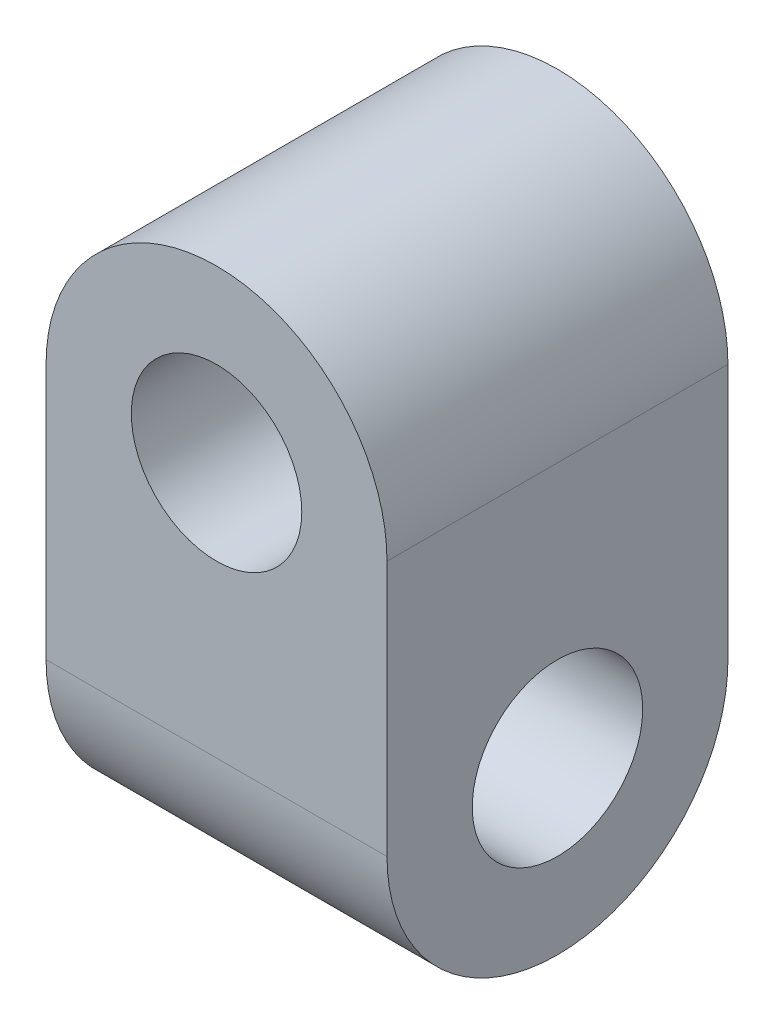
ISO-10303-21;
HEADER;
FILE_DESCRIPTION(('STEP AP214'),'2;1');
FILE_NAME('part.step','',(''),(''),'','','');
FILE_SCHEMA(('AUTOMOTIVE_DESIGN { 1 0 10303 214 1 1 1 1 }'));
ENDSEC;
DATA;
#1=APPLICATION_CONTEXT('core data for automotive mechanical design processes');
#2=APPLICATION_PROTOCOL_DEFINITION('international standard','automotive_design',2000,#1);
#3=PRODUCT_CONTEXT('',#1,'mechanical');
#4=PRODUCT('Part','Part','',(#3));
#5=PRODUCT_RELATED_PRODUCT_CATEGORY('part','',(#4));
#6=PRODUCT_DEFINITION_FORMATION('','',#4);
#7=PRODUCT_DEFINITION_CONTEXT('part definition',#1,'design');
#8=PRODUCT_DEFINITION('design','',#6,#7);
#9=PRODUCT_DEFINITION_SHAPE('','',#8);
#10=(LENGTH_UNIT() NAMED_UNIT(*) SI_UNIT(.MILLI.,.METRE.));
#11=(NAMED_UNIT(*) PLANE_ANGLE_UNIT() SI_UNIT($,.RADIAN.));
#12=(NAMED_UNIT(*) SI_UNIT($,.STERADIAN.) SOLID_ANGLE_UNIT());
#13=UNCERTAINTY_MEASURE_WITH_UNIT(LENGTH_MEASURE(1.E-05),#10,'distance_accuracy_value','');
#14=(GEOMETRIC_REPRESENTATION_CONTEXT(3) GLOBAL_UNCERTAINTY_ASSIGNED_CONTEXT((#13)) GLOBAL_UNIT_ASSIGNED_CONTEXT((#10,
#11,#12)) REPRESENTATION_CONTEXT('',''));
#15=CARTESIAN_POINT('',(0.,0.,0.));
#16=DIRECTION('',(0.,0.,1.));
#17=DIRECTION('',(1.,0.,0.));
#18=AXIS2_PLACEMENT_3D('',#15,#16,#17);
#19=CARTESIAN_POINT('',(182.5,20.,20.));
#20=DIRECTION('',(-1.,0.,0.));
#21=DIRECTION('',(0.,0.,1.));
#22=AXIS2_PLACEMENT_3D('',#19,#20,#21);
#23=CYLINDRICAL_SURFACE('',#22,20.);
#24=CARTESIAN_POINT('',(-20.,20.,20.));
#25=DIRECTION('',(1.,0.,0.));
#26=DIRECTION('',(0.,0.,-1.));
#27=AXIS2_PLACEMENT_3D('',#24,#25,#26);
#28=CIRCLE('',#27,20.);
#29=CARTESIAN_POINT('',(-20.,20.,0.));
#30=VERTEX_POINT('',#29);
#31=CARTESIAN_POINT('',(-20.,20.,40.));
#32=VERTEX_POINT('',#31);
#33=EDGE_CURVE('E374',#30,#32,#28,.F.);
#34=ORIENTED_EDGE('',*,*,#33,.F.);
#35=DIRECTION('',(-1.,0.,0.));
#36=VECTOR('',#35,1.);
#37=CARTESIAN_POINT('',(182.5,20.,0.));
#38=LINE('',#37,#36);
#39=CARTESIAN_POINT('',(20.,20.,0.));
#40=VERTEX_POINT('',#39);
#41=EDGE_CURVE('E11',#30,#40,#38,.F.);
#42=ORIENTED_EDGE('',*,*,#41,.T.);
#43=CARTESIAN_POINT('',(20.,20.,20.));
#44=DIRECTION('',(-1.,0.,0.));
#45=DIRECTION('',(0.,0.,1.));
#46=AXIS2_PLACEMENT_3D('',#43,#44,#45);
#47=CIRCLE('',#46,20.);
#48=CARTESIAN_POINT('',(20.,20.,40.));
#49=VERTEX_POINT('',#48);
#50=EDGE_CURVE('E393',#49,#40,#47,.F.);
#51=ORIENTED_EDGE('',*,*,#50,.F.);
#52=DIRECTION('',(-1.,0.,0.));
#53=VECTOR('',#52,1.);
#54=CARTESIAN_POINT('',(182.5,20.,40.));
#55=LINE('',#54,#53);
#56=EDGE_CURVE('E366',#49,#32,#55,.T.);
#57=ORIENTED_EDGE('',*,*,#56,.T.);
#58=EDGE_LOOP('',(#34,#42,#51,#57));
#59=FACE_BOUND('',#58,.T.);
#60=ADVANCED_FACE('F351',(#59),#23,.T.);
#61=CARTESIAN_POINT('',(0.,50.,40.));
#62=DIRECTION('',(0.,0.,1.));
#63=DIRECTION('',(1.,0.,0.));
#64=AXIS2_PLACEMENT_3D('',#61,#62,#63);
#65=PLANE('',#64);
#66=CARTESIAN_POINT('',(0.,50.,40.));
#67=DIRECTION('',(0.,0.,1.));
#68=DIRECTION('',(1.,0.,0.));
#69=AXIS2_PLACEMENT_3D('',#66,#67,#68);
#70=CIRCLE('',#69,10.);
#71=CARTESIAN_POINT('',(10.,50.,40.));
#72=VERTEX_POINT('',#71);
#73=EDGE_CURVE('E467',#72,#72,#70,.T.);
#74=ORIENTED_EDGE('',*,*,#73,.F.);
#75=EDGE_LOOP('',(#74));
#76=FACE_BOUND('',#75,.T.);
#77=DIRECTION('',(0.,-1.,0.));
#78=VECTOR('',#77,1.);
#79=CARTESIAN_POINT('',(-20.,0.,40.));
#80=LINE('',#79,#78);
#81=CARTESIAN_POINT('',(-20.,50.,40.));
#82=VERTEX_POINT('',#81);
#83=EDGE_CURVE('E414',#82,#32,#80,.T.);
#84=ORIENTED_EDGE('',*,*,#83,.T.);
#85=ORIENTED_EDGE('',*,*,#56,.F.);
#86=DIRECTION('',(0.,1.,0.));
#87=VECTOR('',#86,1.);
#88=CARTESIAN_POINT('',(20.,0.,40.));
#89=LINE('',#88,#87);
#90=CARTESIAN_POINT('',(20.,50.,40.));
#91=VERTEX_POINT('',#90);
#92=EDGE_CURVE('E399',#49,#91,#89,.T.);
#93=ORIENTED_EDGE('',*,*,#92,.T.);
#94=CARTESIAN_POINT('',(0.,50.,40.));
#95=DIRECTION('',(0.,0.,1.));
#96=DIRECTION('',(1.,0.,0.));
#97=AXIS2_PLACEMENT_3D('',#94,#95,#96);
#98=CIRCLE('',#97,20.);
#99=EDGE_CURVE('E417',#91,#82,#98,.T.);
#100=ORIENTED_EDGE('',*,*,#99,.T.);
#101=EDGE_LOOP('',(#84,#85,#93,#100));
#102=FACE_BOUND('',#101,.T.);
#103=ADVANCED_FACE('F425',(#76,#102),#65,.T.);
#104=CARTESIAN_POINT('',(0.,50.,0.));
#105=DIRECTION('',(0.,0.,1.));
#106=DIRECTION('',(1.,0.,0.));
#107=AXIS2_PLACEMENT_3D('',#104,#105,#106);
#108=PLANE('',#107);
#109=CARTESIAN_POINT('',(0.,50.,0.));
#110=DIRECTION('',(0.,0.,1.));
#111=DIRECTION('',(1.,0.,0.));
#112=AXIS2_PLACEMENT_3D('',#109,#110,#111);
#113=CIRCLE('',#112,10.);
#114=CARTESIAN_POINT('',(10.,50.,0.));
#115=VERTEX_POINT('',#114);
#116=EDGE_CURVE('E463',#115,#115,#113,.T.);
#117=ORIENTED_EDGE('',*,*,#116,.T.);
#118=EDGE_LOOP('',(#117));
#119=FACE_BOUND('',#118,.T.);
#120=ORIENTED_EDGE('',*,*,#41,.F.);
#121=DIRECTION('',(0.,-1.,0.));
#122=VECTOR('',#121,1.);
#123=CARTESIAN_POINT('',(-20.,0.,0.));
#124=LINE('',#123,#122);
#125=CARTESIAN_POINT('',(-20.,50.,0.));
#126=VERTEX_POINT('',#125);
#127=EDGE_CURVE('E407',#126,#30,#124,.T.);
#128=ORIENTED_EDGE('',*,*,#127,.F.);
#129=CARTESIAN_POINT('',(0.,50.,0.));
#130=DIRECTION('',(0.,0.,1.));
#131=DIRECTION('',(1.,0.,0.));
#132=AXIS2_PLACEMENT_3D('',#129,#130,#131);
#133=CIRCLE('',#132,20.);
#134=CARTESIAN_POINT('',(20.,50.,0.));
#135=VERTEX_POINT('',#134);
#136=EDGE_CURVE('E406',#135,#126,#133,.T.);
#137=ORIENTED_EDGE('',*,*,#136,.F.);
#138=DIRECTION('',(0.,1.,0.));
#139=VECTOR('',#138,1.);
#140=CARTESIAN_POINT('',(20.,0.,0.));
#141=LINE('',#140,#139);
#142=EDGE_CURVE('E397',#40,#135,#141,.T.);
#143=ORIENTED_EDGE('',*,*,#142,.F.);
#144=EDGE_LOOP('',(#120,#128,#137,#143));
#145=FACE_BOUND('',#144,.T.);
#146=ADVANCED_FACE('F404',(#119,#145),#108,.F.);
#147=CARTESIAN_POINT('',(-20.,0.,40.));
#148=DIRECTION('',(1.,0.,0.));
#149=DIRECTION('',(0.,0.,-1.));
#150=AXIS2_PLACEMENT_3D('',#147,#148,#149);
#151=PLANE('',#150);
#152=CARTESIAN_POINT('',(-20.,20.,20.));
#153=DIRECTION('',(1.,0.,0.));
#154=DIRECTION('',(0.,0.,-1.));
#155=AXIS2_PLACEMENT_3D('',#152,#153,#154);
#156=CIRCLE('',#155,10.);
#157=CARTESIAN_POINT('',(-20.,20.,10.));
#158=VERTEX_POINT('',#157);
#159=EDGE_CURVE('E459',#158,#158,#156,.T.);
#160=ORIENTED_EDGE('',*,*,#159,.T.);
#161=EDGE_LOOP('',(#160));
#162=FACE_BOUND('',#161,.T.);
#163=ORIENTED_EDGE('',*,*,#127,.T.);
#164=ORIENTED_EDGE('',*,*,#33,.T.);
#165=ORIENTED_EDGE('',*,*,#83,.F.);
#166=DIRECTION('',(0.,0.,-1.));
#167=VECTOR('',#166,1.);
#168=CARTESIAN_POINT('',(-20.,50.,40.));
#169=LINE('',#168,#167);
#170=EDGE_CURVE('E419',#82,#126,#169,.T.);
#171=ORIENTED_EDGE('',*,*,#170,.T.);
#172=EDGE_LOOP('',(#163,#164,#165,#171));
#173=FACE_BOUND('',#172,.T.);
#174=ADVANCED_FACE('F353',(#162,#173),#151,.F.);
#175=CARTESIAN_POINT('',(20.,0.,40.));
#176=DIRECTION('',(-1.,0.,0.));
#177=DIRECTION('',(0.,0.,1.));
#178=AXIS2_PLACEMENT_3D('',#175,#176,#177);
#179=PLANE('',#178);
#180=CARTESIAN_POINT('',(20.,20.,20.));
#181=DIRECTION('',(1.,0.,0.));
#182=DIRECTION('',(0.,0.,-1.));
#183=AXIS2_PLACEMENT_3D('',#180,#181,#182);
#184=CIRCLE('',#183,10.);
#185=CARTESIAN_POINT('',(20.,20.,10.));
#186=VERTEX_POINT('',#185);
#187=EDGE_CURVE('E462',#186,#186,#184,.T.);
#188=ORIENTED_EDGE('',*,*,#187,.F.);
#189=EDGE_LOOP('',(#188));
#190=FACE_BOUND('',#189,.T.);
#191=ORIENTED_EDGE('',*,*,#92,.F.);
#192=ORIENTED_EDGE('',*,*,#50,.T.);
#193=ORIENTED_EDGE('',*,*,#142,.T.);
#194=DIRECTION('',(0.,0.,-1.));
#195=VECTOR('',#194,1.);
#196=CARTESIAN_POINT('',(20.,50.,40.));
#197=LINE('',#196,#195);
#198=EDGE_CURVE('E359',#91,#135,#197,.T.);
#199=ORIENTED_EDGE('',*,*,#198,.F.);
#200=EDGE_LOOP('',(#191,#192,#193,#199));
#201=FACE_BOUND('',#200,.T.);
#202=ADVANCED_FACE('F395',(#190,#201),#179,.F.);
#203=CARTESIAN_POINT('',(0.,50.,40.));
#204=DIRECTION('',(0.,0.,-1.));
#205=DIRECTION('',(-1.,0.,0.));
#206=AXIS2_PLACEMENT_3D('',#203,#204,#205);
#207=CYLINDRICAL_SURFACE('',#206,20.);
#208=ORIENTED_EDGE('',*,*,#136,.T.);
#209=ORIENTED_EDGE('',*,*,#170,.F.);
#210=ORIENTED_EDGE('',*,*,#99,.F.);
#211=ORIENTED_EDGE('',*,*,#198,.T.);
#212=EDGE_LOOP('',(#208,#209,#210,#211));
#213=FACE_BOUND('',#212,.T.);
#214=ADVANCED_FACE('F423',(#213),#207,.T.);
#215=CARTESIAN_POINT('',(-20.,20.,20.));
#216=DIRECTION('',(1.,0.,0.));
#217=DIRECTION('',(0.,0.,-1.));
#218=AXIS2_PLACEMENT_3D('',#215,#216,#217);
#219=CYLINDRICAL_SURFACE('',#218,10.);
#220=ORIENTED_EDGE('',*,*,#159,.F.);
#221=EDGE_LOOP('',(#220));
#222=FACE_BOUND('',#221,.T.);
#223=ORIENTED_EDGE('',*,*,#187,.T.);
#224=EDGE_LOOP('',(#223));
#225=FACE_BOUND('',#224,.T.);
#226=ADVANCED_FACE('F445',(#222,#225),#219,.F.);
#227=CARTESIAN_POINT('',(0.,50.,0.));
#228=DIRECTION('',(0.,0.,1.));
#229=DIRECTION('',(1.,0.,0.));
#230=AXIS2_PLACEMENT_3D('',#227,#228,#229);
#231=CYLINDRICAL_SURFACE('',#230,10.);
#232=ORIENTED_EDGE('',*,*,#116,.F.);
#233=EDGE_LOOP('',(#232));
#234=FACE_BOUND('',#233,.T.);
#235=ORIENTED_EDGE('',*,*,#73,.T.);
#236=EDGE_LOOP('',(#235));
#237=FACE_BOUND('',#236,.T.);
#238=ADVANCED_FACE('F451',(#234,#237),#231,.F.);
#239=CLOSED_SHELL('',(#60,#103,#146,#174,#202,#214,#226,#238));
#240=MANIFOLD_SOLID_BREP('B2',#239);
#241=ADVANCED_BREP_SHAPE_REPRESENTATION('',(#18,#240),#14);
#242=SHAPE_DEFINITION_REPRESENTATION(#9,#241);
ENDSEC;
END-ISO-10303-21;
